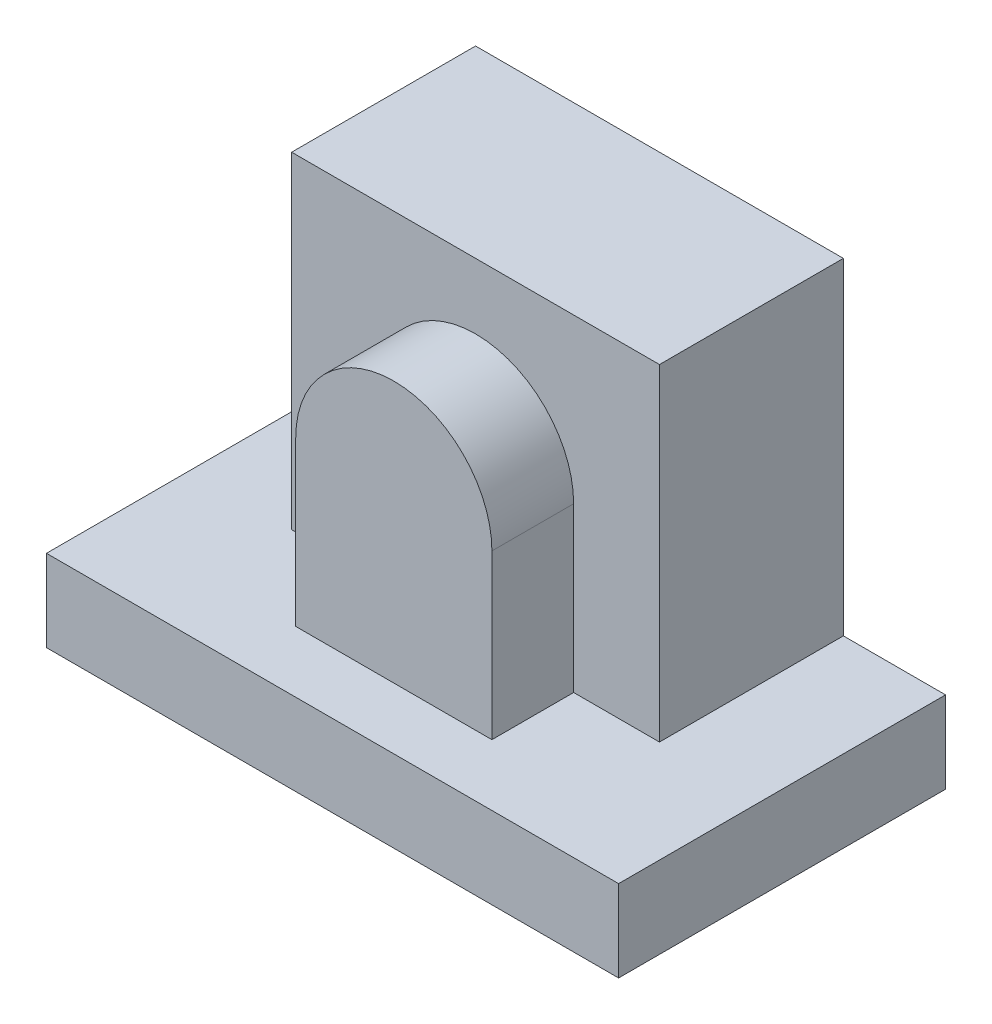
ISO-10303-21;
HEADER;
FILE_DESCRIPTION(('STEP AP214'),'2;1');
FILE_NAME('part.step','',(''),(''),'','','');
FILE_SCHEMA(('AUTOMOTIVE_DESIGN { 1 0 10303 214 1 1 1 1 }'));
ENDSEC;
DATA;
#1=APPLICATION_CONTEXT('core data for automotive mechanical design processes');
#2=APPLICATION_PROTOCOL_DEFINITION('international standard','automotive_design',2000,#1);
#3=PRODUCT_CONTEXT('',#1,'mechanical');
#4=PRODUCT('Part','Part','',(#3));
#5=PRODUCT_RELATED_PRODUCT_CATEGORY('part','',(#4));
#6=PRODUCT_DEFINITION_FORMATION('','',#4);
#7=PRODUCT_DEFINITION_CONTEXT('part definition',#1,'design');
#8=PRODUCT_DEFINITION('design','',#6,#7);
#9=PRODUCT_DEFINITION_SHAPE('','',#8);
#10=(LENGTH_UNIT() NAMED_UNIT(*) SI_UNIT(.MILLI.,.METRE.));
#11=(NAMED_UNIT(*) PLANE_ANGLE_UNIT() SI_UNIT($,.RADIAN.));
#12=(NAMED_UNIT(*) SI_UNIT($,.STERADIAN.) SOLID_ANGLE_UNIT());
#13=UNCERTAINTY_MEASURE_WITH_UNIT(LENGTH_MEASURE(1.E-05),#10,'distance_accuracy_value','');
#14=(GEOMETRIC_REPRESENTATION_CONTEXT(3) GLOBAL_UNCERTAINTY_ASSIGNED_CONTEXT((#13)) GLOBAL_UNIT_ASSIGNED_CONTEXT((#10,
#11,#12)) REPRESENTATION_CONTEXT('',''));
#15=CARTESIAN_POINT('',(0.,0.,0.));
#16=DIRECTION('',(0.,0.,1.));
#17=DIRECTION('',(1.,0.,0.));
#18=AXIS2_PLACEMENT_3D('',#15,#16,#17);
#19=CARTESIAN_POINT('',(-70.,20.,0.));
#20=DIRECTION('',(0.,1.,0.));
#21=DIRECTION('',(0.,0.,1.));
#22=AXIS2_PLACEMENT_3D('',#19,#20,#21);
#23=PLANE('',#22);
#24=DIRECTION('',(1.,0.,0.));
#25=VECTOR('',#24,1.);
#26=CARTESIAN_POINT('',(-45.,20.,45.));
#27=LINE('',#26,#25);
#28=CARTESIAN_POINT('',(24.,20.,45.));
#29=VERTEX_POINT('',#28);
#30=CARTESIAN_POINT('',(45.,20.,45.));
#31=VERTEX_POINT('',#30);
#32=EDGE_CURVE('E146',#29,#31,#27,.T.);
#33=ORIENTED_EDGE('',*,*,#32,.F.);
#34=DIRECTION('',(0.,0.,-1.));
#35=VECTOR('',#34,1.);
#36=CARTESIAN_POINT('',(24.,20.,65.));
#37=LINE('',#36,#35);
#38=CARTESIAN_POINT('',(24.,20.,65.));
#39=VERTEX_POINT('',#38);
#40=EDGE_CURVE('E53',#39,#29,#37,.T.);
#41=ORIENTED_EDGE('',*,*,#40,.F.);
#42=DIRECTION('',(1.,0.,0.));
#43=VECTOR('',#42,1.);
#44=CARTESIAN_POINT('',(24.,20.,65.));
#45=LINE('',#44,#43);
#46=CARTESIAN_POINT('',(-24.,20.,65.));
#47=VERTEX_POINT('',#46);
#48=EDGE_CURVE('E48',#47,#39,#45,.T.);
#49=ORIENTED_EDGE('',*,*,#48,.F.);
#50=DIRECTION('',(0.,0.,-1.));
#51=VECTOR('',#50,1.);
#52=CARTESIAN_POINT('',(-24.,20.,65.));
#53=LINE('',#52,#51);
#54=CARTESIAN_POINT('',(-24.,20.,45.));
#55=VERTEX_POINT('',#54);
#56=EDGE_CURVE('E148',#47,#55,#53,.T.);
#57=ORIENTED_EDGE('',*,*,#56,.T.);
#58=CARTESIAN_POINT('',(-45.,20.,45.));
#59=VERTEX_POINT('',#58);
#60=EDGE_CURVE('E163',#59,#55,#27,.T.);
#61=ORIENTED_EDGE('',*,*,#60,.F.);
#62=DIRECTION('',(0.,0.,1.));
#63=VECTOR('',#62,1.);
#64=CARTESIAN_POINT('',(-45.,20.,0.));
#65=LINE('',#64,#63);
#66=CARTESIAN_POINT('',(-45.,20.,0.));
#67=VERTEX_POINT('',#66);
#68=EDGE_CURVE('E143',#67,#59,#65,.T.);
#69=ORIENTED_EDGE('',*,*,#68,.F.);
#70=DIRECTION('',(-1.,0.,0.));
#71=VECTOR('',#70,1.);
#72=CARTESIAN_POINT('',(-70.,20.,0.));
#73=LINE('',#72,#71);
#74=CARTESIAN_POINT('',(-70.,20.,0.));
#75=VERTEX_POINT('',#74);
#76=EDGE_CURVE('E189',#67,#75,#73,.T.);
#77=ORIENTED_EDGE('',*,*,#76,.T.);
#78=DIRECTION('',(0.,0.,1.));
#79=VECTOR('',#78,1.);
#80=CARTESIAN_POINT('',(-70.,20.,0.));
#81=LINE('',#80,#79);
#82=CARTESIAN_POINT('',(-70.,20.,80.));
#83=VERTEX_POINT('',#82);
#84=EDGE_CURVE('E208',#75,#83,#81,.T.);
#85=ORIENTED_EDGE('',*,*,#84,.T.);
#86=DIRECTION('',(1.,0.,0.));
#87=VECTOR('',#86,1.);
#88=CARTESIAN_POINT('',(-70.,20.,80.));
#89=LINE('',#88,#87);
#90=CARTESIAN_POINT('',(70.,20.,80.));
#91=VERTEX_POINT('',#90);
#92=EDGE_CURVE('E234',#83,#91,#89,.T.);
#93=ORIENTED_EDGE('',*,*,#92,.T.);
#94=DIRECTION('',(0.,0.,-1.));
#95=VECTOR('',#94,1.);
#96=CARTESIAN_POINT('',(70.,20.,0.));
#97=LINE('',#96,#95);
#98=CARTESIAN_POINT('',(70.,20.,0.));
#99=VERTEX_POINT('',#98);
#100=EDGE_CURVE('E193',#91,#99,#97,.T.);
#101=ORIENTED_EDGE('',*,*,#100,.T.);
#102=CARTESIAN_POINT('',(45.,20.,0.));
#103=VERTEX_POINT('',#102);
#104=EDGE_CURVE('E192',#99,#103,#73,.T.);
#105=ORIENTED_EDGE('',*,*,#104,.T.);
#106=DIRECTION('',(0.,0.,-1.));
#107=VECTOR('',#106,1.);
#108=CARTESIAN_POINT('',(45.,20.,0.));
#109=LINE('',#108,#107);
#110=EDGE_CURVE('E156',#31,#103,#109,.T.);
#111=ORIENTED_EDGE('',*,*,#110,.F.);
#112=EDGE_LOOP('',(#33,#41,#49,#57,#61,#69,#77,#85,#93,#101,#105,#111));
#113=FACE_BOUND('',#112,.T.);
#114=ADVANCED_FACE('F31',(#113),#23,.T.);
#115=CARTESIAN_POINT('',(-45.,100.,45.));
#116=DIRECTION('',(0.,0.,-1.));
#117=DIRECTION('',(-1.,0.,0.));
#118=AXIS2_PLACEMENT_3D('',#115,#116,#117);
#119=PLANE('',#118);
#120=DIRECTION('',(0.,1.,0.));
#121=VECTOR('',#120,1.);
#122=CARTESIAN_POINT('',(24.,60.,45.));
#123=LINE('',#122,#121);
#124=CARTESIAN_POINT('',(24.,60.,45.));
#125=VERTEX_POINT('',#124);
#126=EDGE_CURVE('E142',#29,#125,#123,.T.);
#127=ORIENTED_EDGE('',*,*,#126,.F.);
#128=ORIENTED_EDGE('',*,*,#32,.T.);
#129=DIRECTION('',(0.,-1.,0.));
#130=VECTOR('',#129,1.);
#131=CARTESIAN_POINT('',(45.,100.,45.));
#132=LINE('',#131,#130);
#133=CARTESIAN_POINT('',(45.,100.,45.));
#134=VERTEX_POINT('',#133);
#135=EDGE_CURVE('E167',#134,#31,#132,.T.);
#136=ORIENTED_EDGE('',*,*,#135,.F.);
#137=DIRECTION('',(1.,0.,0.));
#138=VECTOR('',#137,1.);
#139=CARTESIAN_POINT('',(-45.,100.,45.));
#140=LINE('',#139,#138);
#141=CARTESIAN_POINT('',(-45.,100.,45.));
#142=VERTEX_POINT('',#141);
#143=EDGE_CURVE('E155',#142,#134,#140,.T.);
#144=ORIENTED_EDGE('',*,*,#143,.F.);
#145=DIRECTION('',(0.,-1.,0.));
#146=VECTOR('',#145,1.);
#147=CARTESIAN_POINT('',(-45.,100.,45.));
#148=LINE('',#147,#146);
#149=EDGE_CURVE('E181',#142,#59,#148,.T.);
#150=ORIENTED_EDGE('',*,*,#149,.T.);
#151=ORIENTED_EDGE('',*,*,#60,.T.);
#152=DIRECTION('',(0.,-1.,0.));
#153=VECTOR('',#152,1.);
#154=CARTESIAN_POINT('',(-24.,20.,45.));
#155=LINE('',#154,#153);
#156=CARTESIAN_POINT('',(-24.,60.,45.));
#157=VERTEX_POINT('',#156);
#158=EDGE_CURVE('E139',#157,#55,#155,.T.);
#159=ORIENTED_EDGE('',*,*,#158,.F.);
#160=CARTESIAN_POINT('',(0.,60.,45.));
#161=DIRECTION('',(0.,0.,1.));
#162=DIRECTION('',(-1.,0.,0.));
#163=AXIS2_PLACEMENT_3D('',#160,#161,#162);
#164=CIRCLE('',#163,24.);
#165=EDGE_CURVE('E366',#125,#157,#164,.T.);
#166=ORIENTED_EDGE('',*,*,#165,.F.);
#167=EDGE_LOOP('',(#127,#128,#136,#144,#150,#151,#159,#166));
#168=FACE_BOUND('',#167,.T.);
#169=ADVANCED_FACE('F239',(#168),#119,.F.);
#170=CARTESIAN_POINT('',(-70.,20.,0.));
#171=DIRECTION('',(1.,0.,0.));
#172=DIRECTION('',(0.,0.,-1.));
#173=AXIS2_PLACEMENT_3D('',#170,#171,#172);
#174=PLANE('',#173);
#175=DIRECTION('',(0.,0.,1.));
#176=VECTOR('',#175,1.);
#177=CARTESIAN_POINT('',(-70.,0.,0.));
#178=LINE('',#177,#176);
#179=CARTESIAN_POINT('',(-70.,0.,0.));
#180=VERTEX_POINT('',#179);
#181=CARTESIAN_POINT('',(-70.,0.,80.));
#182=VERTEX_POINT('',#181);
#183=EDGE_CURVE('E198',#180,#182,#178,.T.);
#184=ORIENTED_EDGE('',*,*,#183,.T.);
#185=DIRECTION('',(0.,-1.,0.));
#186=VECTOR('',#185,1.);
#187=CARTESIAN_POINT('',(-70.,20.,80.));
#188=LINE('',#187,#186);
#189=EDGE_CURVE('E11',#83,#182,#188,.T.);
#190=ORIENTED_EDGE('',*,*,#189,.F.);
#191=ORIENTED_EDGE('',*,*,#84,.F.);
#192=DIRECTION('',(0.,-1.,0.));
#193=VECTOR('',#192,1.);
#194=CARTESIAN_POINT('',(-70.,20.,0.));
#195=LINE('',#194,#193);
#196=EDGE_CURVE('E209',#75,#180,#195,.T.);
#197=ORIENTED_EDGE('',*,*,#196,.T.);
#198=EDGE_LOOP('',(#184,#190,#191,#197));
#199=FACE_BOUND('',#198,.T.);
#200=ADVANCED_FACE('F33',(#199),#174,.F.);
#201=CARTESIAN_POINT('',(-70.,20.,80.));
#202=DIRECTION('',(0.,0.,-1.));
#203=DIRECTION('',(-1.,0.,0.));
#204=AXIS2_PLACEMENT_3D('',#201,#202,#203);
#205=PLANE('',#204);
#206=DIRECTION('',(1.,0.,0.));
#207=VECTOR('',#206,1.);
#208=CARTESIAN_POINT('',(-70.,0.,80.));
#209=LINE('',#208,#207);
#210=CARTESIAN_POINT('',(70.,0.,80.));
#211=VERTEX_POINT('',#210);
#212=EDGE_CURVE('E202',#182,#211,#209,.T.);
#213=ORIENTED_EDGE('',*,*,#212,.T.);
#214=DIRECTION('',(0.,-1.,0.));
#215=VECTOR('',#214,1.);
#216=CARTESIAN_POINT('',(70.,20.,80.));
#217=LINE('',#216,#215);
#218=EDGE_CURVE('E40',#91,#211,#217,.T.);
#219=ORIENTED_EDGE('',*,*,#218,.F.);
#220=ORIENTED_EDGE('',*,*,#92,.F.);
#221=ORIENTED_EDGE('',*,*,#189,.T.);
#222=EDGE_LOOP('',(#213,#219,#220,#221));
#223=FACE_BOUND('',#222,.T.);
#224=ADVANCED_FACE('F248',(#223),#205,.F.);
#225=CARTESIAN_POINT('',(70.,20.,0.));
#226=DIRECTION('',(-1.,0.,0.));
#227=DIRECTION('',(0.,0.,1.));
#228=AXIS2_PLACEMENT_3D('',#225,#226,#227);
#229=PLANE('',#228);
#230=DIRECTION('',(0.,0.,-1.));
#231=VECTOR('',#230,1.);
#232=CARTESIAN_POINT('',(70.,0.,0.));
#233=LINE('',#232,#231);
#234=CARTESIAN_POINT('',(70.,0.,0.));
#235=VERTEX_POINT('',#234);
#236=EDGE_CURVE('E204',#211,#235,#233,.T.);
#237=ORIENTED_EDGE('',*,*,#236,.T.);
#238=DIRECTION('',(0.,-1.,0.));
#239=VECTOR('',#238,1.);
#240=CARTESIAN_POINT('',(70.,20.,0.));
#241=LINE('',#240,#239);
#242=EDGE_CURVE('E212',#99,#235,#241,.T.);
#243=ORIENTED_EDGE('',*,*,#242,.F.);
#244=ORIENTED_EDGE('',*,*,#100,.F.);
#245=ORIENTED_EDGE('',*,*,#218,.T.);
#246=EDGE_LOOP('',(#237,#243,#244,#245));
#247=FACE_BOUND('',#246,.T.);
#248=ADVANCED_FACE('F220',(#247),#229,.F.);
#249=CARTESIAN_POINT('',(-70.,20.,0.));
#250=DIRECTION('',(0.,0.,1.));
#251=DIRECTION('',(1.,0.,0.));
#252=AXIS2_PLACEMENT_3D('',#249,#250,#251);
#253=PLANE('',#252);
#254=DIRECTION('',(-1.,0.,0.));
#255=VECTOR('',#254,1.);
#256=CARTESIAN_POINT('',(-70.,0.,0.));
#257=LINE('',#256,#255);
#258=EDGE_CURVE('E206',#235,#180,#257,.T.);
#259=ORIENTED_EDGE('',*,*,#258,.T.);
#260=ORIENTED_EDGE('',*,*,#196,.F.);
#261=ORIENTED_EDGE('',*,*,#76,.F.);
#262=DIRECTION('',(0.,-1.,0.));
#263=VECTOR('',#262,1.);
#264=CARTESIAN_POINT('',(-45.,100.,0.));
#265=LINE('',#264,#263);
#266=CARTESIAN_POINT('',(-45.,100.,0.));
#267=VERTEX_POINT('',#266);
#268=EDGE_CURVE('E162',#267,#67,#265,.T.);
#269=ORIENTED_EDGE('',*,*,#268,.F.);
#270=DIRECTION('',(-1.,0.,0.));
#271=VECTOR('',#270,1.);
#272=CARTESIAN_POINT('',(-45.,100.,0.));
#273=LINE('',#272,#271);
#274=CARTESIAN_POINT('',(45.,100.,0.));
#275=VERTEX_POINT('',#274);
#276=EDGE_CURVE('E160',#275,#267,#273,.T.);
#277=ORIENTED_EDGE('',*,*,#276,.F.);
#278=DIRECTION('',(0.,-1.,0.));
#279=VECTOR('',#278,1.);
#280=CARTESIAN_POINT('',(45.,100.,0.));
#281=LINE('',#280,#279);
#282=EDGE_CURVE('E174',#275,#103,#281,.T.);
#283=ORIENTED_EDGE('',*,*,#282,.T.);
#284=ORIENTED_EDGE('',*,*,#104,.F.);
#285=ORIENTED_EDGE('',*,*,#242,.T.);
#286=EDGE_LOOP('',(#259,#260,#261,#269,#277,#283,#284,#285));
#287=FACE_BOUND('',#286,.T.);
#288=ADVANCED_FACE('F228',(#287),#253,.F.);
#289=CARTESIAN_POINT('',(-70.,0.,0.));
#290=DIRECTION('',(0.,1.,0.));
#291=DIRECTION('',(0.,0.,1.));
#292=AXIS2_PLACEMENT_3D('',#289,#290,#291);
#293=PLANE('',#292);
#294=ORIENTED_EDGE('',*,*,#183,.F.);
#295=ORIENTED_EDGE('',*,*,#258,.F.);
#296=ORIENTED_EDGE('',*,*,#236,.F.);
#297=ORIENTED_EDGE('',*,*,#212,.F.);
#298=EDGE_LOOP('',(#294,#295,#296,#297));
#299=FACE_BOUND('',#298,.T.);
#300=ADVANCED_FACE('F226',(#299),#293,.F.);
#301=CARTESIAN_POINT('',(-45.,100.,0.));
#302=DIRECTION('',(1.,0.,0.));
#303=DIRECTION('',(0.,0.,-1.));
#304=AXIS2_PLACEMENT_3D('',#301,#302,#303);
#305=PLANE('',#304);
#306=ORIENTED_EDGE('',*,*,#68,.T.);
#307=ORIENTED_EDGE('',*,*,#149,.F.);
#308=DIRECTION('',(0.,0.,1.));
#309=VECTOR('',#308,1.);
#310=CARTESIAN_POINT('',(-45.,100.,0.));
#311=LINE('',#310,#309);
#312=EDGE_CURVE('E152',#267,#142,#311,.T.);
#313=ORIENTED_EDGE('',*,*,#312,.F.);
#314=ORIENTED_EDGE('',*,*,#268,.T.);
#315=EDGE_LOOP('',(#306,#307,#313,#314));
#316=FACE_BOUND('',#315,.T.);
#317=ADVANCED_FACE('F241',(#316),#305,.F.);
#318=CARTESIAN_POINT('',(45.,100.,0.));
#319=DIRECTION('',(-1.,0.,0.));
#320=DIRECTION('',(0.,0.,1.));
#321=AXIS2_PLACEMENT_3D('',#318,#319,#320);
#322=PLANE('',#321);
#323=ORIENTED_EDGE('',*,*,#110,.T.);
#324=ORIENTED_EDGE('',*,*,#282,.F.);
#325=DIRECTION('',(0.,0.,-1.));
#326=VECTOR('',#325,1.);
#327=CARTESIAN_POINT('',(45.,100.,0.));
#328=LINE('',#327,#326);
#329=EDGE_CURVE('E158',#134,#275,#328,.T.);
#330=ORIENTED_EDGE('',*,*,#329,.F.);
#331=ORIENTED_EDGE('',*,*,#135,.T.);
#332=EDGE_LOOP('',(#323,#324,#330,#331));
#333=FACE_BOUND('',#332,.T.);
#334=ADVANCED_FACE('F246',(#333),#322,.F.);
#335=CARTESIAN_POINT('',(-45.,100.,45.));
#336=DIRECTION('',(0.,1.,0.));
#337=DIRECTION('',(0.,0.,1.));
#338=AXIS2_PLACEMENT_3D('',#335,#336,#337);
#339=PLANE('',#338);
#340=ORIENTED_EDGE('',*,*,#312,.T.);
#341=ORIENTED_EDGE('',*,*,#143,.T.);
#342=ORIENTED_EDGE('',*,*,#329,.T.);
#343=ORIENTED_EDGE('',*,*,#276,.T.);
#344=EDGE_LOOP('',(#340,#341,#342,#343));
#345=FACE_BOUND('',#344,.T.);
#346=ADVANCED_FACE('F243',(#345),#339,.T.);
#347=CARTESIAN_POINT('',(24.,60.,65.));
#348=DIRECTION('',(-1.,0.,0.));
#349=DIRECTION('',(0.,0.,1.));
#350=AXIS2_PLACEMENT_3D('',#347,#348,#349);
#351=PLANE('',#350);
#352=ORIENTED_EDGE('',*,*,#126,.T.);
#353=DIRECTION('',(0.,0.,-1.));
#354=VECTOR('',#353,1.);
#355=CARTESIAN_POINT('',(24.,60.,65.));
#356=LINE('',#355,#354);
#357=CARTESIAN_POINT('',(24.,60.,65.));
#358=VERTEX_POINT('',#357);
#359=EDGE_CURVE('E127',#358,#125,#356,.T.);
#360=ORIENTED_EDGE('',*,*,#359,.F.);
#361=DIRECTION('',(0.,1.,0.));
#362=VECTOR('',#361,1.);
#363=CARTESIAN_POINT('',(24.,60.,65.));
#364=LINE('',#363,#362);
#365=EDGE_CURVE('E134',#39,#358,#364,.T.);
#366=ORIENTED_EDGE('',*,*,#365,.F.);
#367=ORIENTED_EDGE('',*,*,#40,.T.);
#368=EDGE_LOOP('',(#352,#360,#366,#367));
#369=FACE_BOUND('',#368,.T.);
#370=ADVANCED_FACE('F141',(#369),#351,.F.);
#371=CARTESIAN_POINT('',(0.,60.,65.));
#372=DIRECTION('',(0.,0.,-1.));
#373=DIRECTION('',(-1.,0.,0.));
#374=AXIS2_PLACEMENT_3D('',#371,#372,#373);
#375=CYLINDRICAL_SURFACE('',#374,24.);
#376=ORIENTED_EDGE('',*,*,#165,.T.);
#377=DIRECTION('',(0.,0.,-1.));
#378=VECTOR('',#377,1.);
#379=CARTESIAN_POINT('',(-24.,60.,65.));
#380=LINE('',#379,#378);
#381=CARTESIAN_POINT('',(-24.,60.,65.));
#382=VERTEX_POINT('',#381);
#383=EDGE_CURVE('E130',#382,#157,#380,.T.);
#384=ORIENTED_EDGE('',*,*,#383,.F.);
#385=CARTESIAN_POINT('',(0.,60.,65.));
#386=DIRECTION('',(0.,0.,1.));
#387=DIRECTION('',(-1.,0.,0.));
#388=AXIS2_PLACEMENT_3D('',#385,#386,#387);
#389=CIRCLE('',#388,24.);
#390=EDGE_CURVE('E122',#358,#382,#389,.T.);
#391=ORIENTED_EDGE('',*,*,#390,.F.);
#392=ORIENTED_EDGE('',*,*,#359,.T.);
#393=EDGE_LOOP('',(#376,#384,#391,#392));
#394=FACE_BOUND('',#393,.T.);
#395=ADVANCED_FACE('F125',(#394),#375,.T.);
#396=CARTESIAN_POINT('',(-24.,20.,65.));
#397=DIRECTION('',(1.,0.,0.));
#398=DIRECTION('',(0.,0.,-1.));
#399=AXIS2_PLACEMENT_3D('',#396,#397,#398);
#400=PLANE('',#399);
#401=ORIENTED_EDGE('',*,*,#158,.T.);
#402=ORIENTED_EDGE('',*,*,#56,.F.);
#403=DIRECTION('',(0.,-1.,0.));
#404=VECTOR('',#403,1.);
#405=CARTESIAN_POINT('',(-24.,20.,65.));
#406=LINE('',#405,#404);
#407=EDGE_CURVE('E133',#382,#47,#406,.T.);
#408=ORIENTED_EDGE('',*,*,#407,.F.);
#409=ORIENTED_EDGE('',*,*,#383,.T.);
#410=EDGE_LOOP('',(#401,#402,#408,#409));
#411=FACE_BOUND('',#410,.T.);
#412=ADVANCED_FACE('F304',(#411),#400,.F.);
#413=CARTESIAN_POINT('',(0.,60.,65.));
#414=DIRECTION('',(0.,0.,-1.));
#415=DIRECTION('',(-1.,0.,0.));
#416=AXIS2_PLACEMENT_3D('',#413,#414,#415);
#417=PLANE('',#416);
#418=ORIENTED_EDGE('',*,*,#365,.T.);
#419=ORIENTED_EDGE('',*,*,#390,.T.);
#420=ORIENTED_EDGE('',*,*,#407,.T.);
#421=ORIENTED_EDGE('',*,*,#48,.T.);
#422=EDGE_LOOP('',(#418,#419,#420,#421));
#423=FACE_BOUND('',#422,.T.);
#424=ADVANCED_FACE('F137',(#423),#417,.F.);
#425=CLOSED_SHELL('',(#114,#169,#200,#224,#248,#288,#300,#317,#334,#346,#370,#395,#412,#424));
#426=MANIFOLD_SOLID_BREP('B2',#425);
#427=ADVANCED_BREP_SHAPE_REPRESENTATION('',(#18,#426),#14);
#428=SHAPE_DEFINITION_REPRESENTATION(#9,#427);
ENDSEC;
END-ISO-10303-21;
